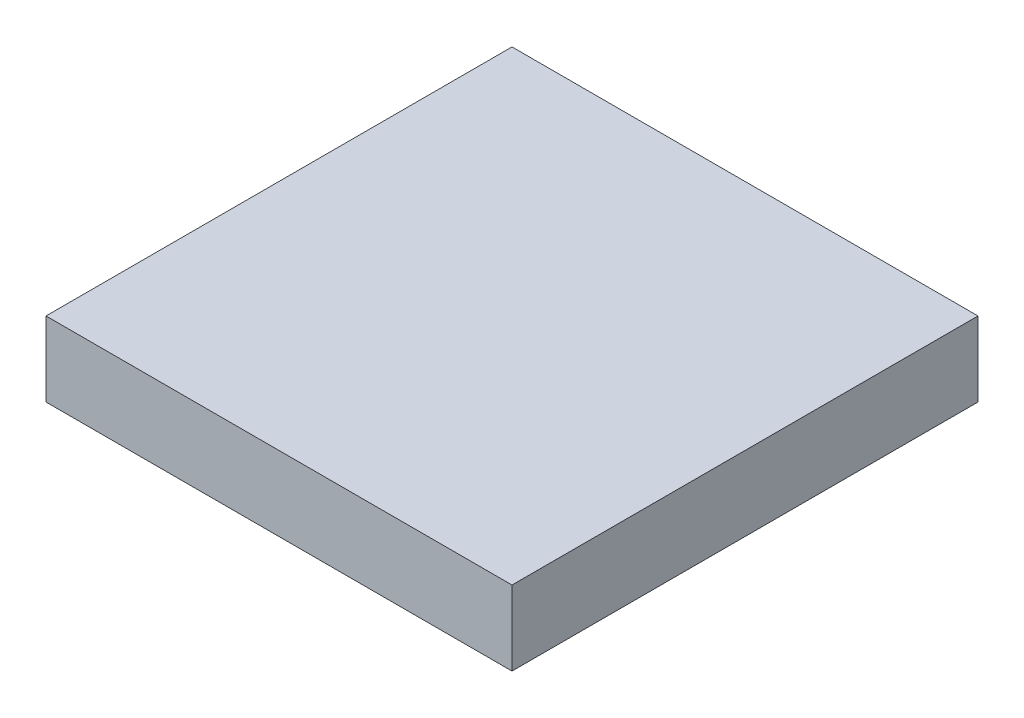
from build123d import *

# Parameters (mm, degrees)
SKETCH1_W          = 100
SKETCH1_H          = 100
BASE_EXTRUDE_DEPTH = 16


with BuildPart() as part:
    # Sketch1 → Base-Extrude (new body)
    with BuildSketch(Plane(origin=(0, 0, 0), x_dir=(1, 0, 0), z_dir=(0, 1, 0))):
        Rectangle(SKETCH1_W, SKETCH1_H)
    extrude(amount=BASE_EXTRUDE_DEPTH)


solid = part.part
